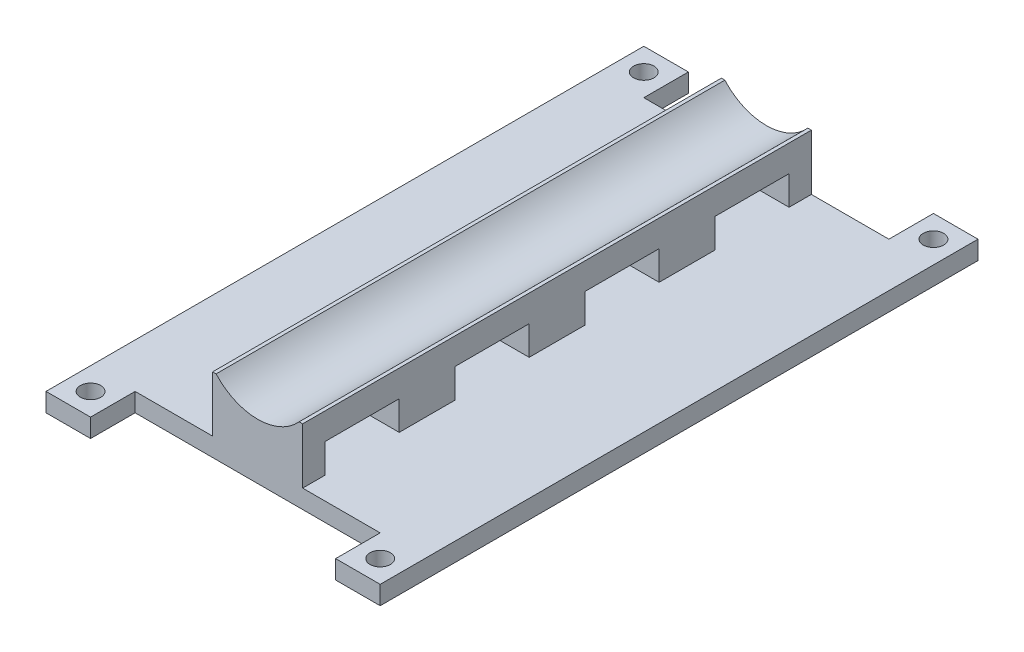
ISO-10303-21;
HEADER;
FILE_DESCRIPTION(('STEP AP214'),'2;1');
FILE_NAME('part.step','',(''),(''),'','','');
FILE_SCHEMA(('AUTOMOTIVE_DESIGN { 1 0 10303 214 1 1 1 1 }'));
ENDSEC;
DATA;
#1=APPLICATION_CONTEXT('core data for automotive mechanical design processes');
#2=APPLICATION_PROTOCOL_DEFINITION('international standard','automotive_design',2000,#1);
#3=PRODUCT_CONTEXT('',#1,'mechanical');
#4=PRODUCT('Part','Part','',(#3));
#5=PRODUCT_RELATED_PRODUCT_CATEGORY('part','',(#4));
#6=PRODUCT_DEFINITION_FORMATION('','',#4);
#7=PRODUCT_DEFINITION_CONTEXT('part definition',#1,'design');
#8=PRODUCT_DEFINITION('design','',#6,#7);
#9=PRODUCT_DEFINITION_SHAPE('','',#8);
#10=(LENGTH_UNIT() NAMED_UNIT(*) SI_UNIT(.MILLI.,.METRE.));
#11=(NAMED_UNIT(*) PLANE_ANGLE_UNIT() SI_UNIT($,.RADIAN.));
#12=(NAMED_UNIT(*) SI_UNIT($,.STERADIAN.) SOLID_ANGLE_UNIT());
#13=UNCERTAINTY_MEASURE_WITH_UNIT(LENGTH_MEASURE(1.E-05),#10,'distance_accuracy_value','');
#14=(GEOMETRIC_REPRESENTATION_CONTEXT(3) GLOBAL_UNCERTAINTY_ASSIGNED_CONTEXT((#13)) GLOBAL_UNIT_ASSIGNED_CONTEXT((#10,
#11,#12)) REPRESENTATION_CONTEXT('',''));
#15=CARTESIAN_POINT('',(0.,0.,0.));
#16=DIRECTION('',(0.,0.,1.));
#17=DIRECTION('',(1.,0.,0.));
#18=AXIS2_PLACEMENT_3D('',#15,#16,#17);
#19=CARTESIAN_POINT('',(0.,5.,0.));
#20=DIRECTION('',(0.,1.,0.));
#21=DIRECTION('',(0.,0.,1.));
#22=AXIS2_PLACEMENT_3D('',#19,#20,#21);
#23=PLANE('',#22);
#24=DIRECTION('',(0.,0.,1.));
#25=VECTOR('',#24,1.);
#26=CARTESIAN_POINT('',(32.8767673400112,5.,-149.));
#27=LINE('',#26,#25);
#28=CARTESIAN_POINT('',(32.8767673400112,4.99999999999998,-53.));
#29=VERTEX_POINT('',#28);
#30=CARTESIAN_POINT('',(32.8767673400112,4.99999999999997,-38.));
#31=VERTEX_POINT('',#30);
#32=EDGE_CURVE('E361',#29,#31,#27,.T.);
#33=ORIENTED_EDGE('',*,*,#32,.F.);
#34=DIRECTION('',(1.,0.,0.));
#35=VECTOR('',#34,1.);
#36=CARTESIAN_POINT('',(0.,4.99999999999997,-53.));
#37=LINE('',#36,#35);
#38=CARTESIAN_POINT('',(57.1232326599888,4.99999999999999,-53.));
#39=VERTEX_POINT('',#38);
#40=EDGE_CURVE('E582',#29,#39,#37,.T.);
#41=ORIENTED_EDGE('',*,*,#40,.T.);
#42=DIRECTION('',(0.,0.,1.));
#43=VECTOR('',#42,1.);
#44=CARTESIAN_POINT('',(57.1232326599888,5.00000000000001,-149.));
#45=LINE('',#44,#43);
#46=CARTESIAN_POINT('',(57.1232326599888,4.99999999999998,-38.));
#47=VERTEX_POINT('',#46);
#48=EDGE_CURVE('E352',#39,#47,#45,.T.);
#49=ORIENTED_EDGE('',*,*,#48,.T.);
#50=DIRECTION('',(1.,0.,0.));
#51=VECTOR('',#50,1.);
#52=CARTESIAN_POINT('',(0.,4.99999999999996,-38.));
#53=LINE('',#52,#51);
#54=EDGE_CURVE('E510',#31,#47,#53,.T.);
#55=ORIENTED_EDGE('',*,*,#54,.F.);
#56=EDGE_LOOP('',(#33,#41,#49,#55));
#57=FACE_BOUND('',#56,.T.);
#58=DIRECTION('',(0.,0.,1.));
#59=VECTOR('',#58,1.);
#60=CARTESIAN_POINT('',(0.,5.,-161.));
#61=LINE('',#60,#59);
#62=CARTESIAN_POINT('',(0.,5.,-161.));
#63=VERTEX_POINT('',#62);
#64=CARTESIAN_POINT('',(0.,5.,0.));
#65=VERTEX_POINT('',#64);
#66=EDGE_CURVE('E119',#63,#65,#61,.T.);
#67=ORIENTED_EDGE('',*,*,#66,.T.);
#68=DIRECTION('',(1.,0.,0.));
#69=VECTOR('',#68,1.);
#70=CARTESIAN_POINT('',(0.,5.,0.));
#71=LINE('',#70,#69);
#72=CARTESIAN_POINT('',(12.,5.,0.));
#73=VERTEX_POINT('',#72);
#74=EDGE_CURVE('E459',#65,#73,#71,.T.);
#75=ORIENTED_EDGE('',*,*,#74,.T.);
#76=DIRECTION('',(0.,0.,-1.));
#77=VECTOR('',#76,1.);
#78=CARTESIAN_POINT('',(12.,5.,0.));
#79=LINE('',#78,#77);
#80=CARTESIAN_POINT('',(12.,5.,-12.));
#81=VERTEX_POINT('',#80);
#82=EDGE_CURVE('E453',#73,#81,#79,.T.);
#83=ORIENTED_EDGE('',*,*,#82,.T.);
#84=DIRECTION('',(1.,0.,0.));
#85=VECTOR('',#84,1.);
#86=CARTESIAN_POINT('',(12.,5.,-12.));
#87=LINE('',#86,#85);
#88=CARTESIAN_POINT('',(32.8767673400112,5.,-12.));
#89=VERTEX_POINT('',#88);
#90=EDGE_CURVE('E452',#81,#89,#87,.T.);
#91=ORIENTED_EDGE('',*,*,#90,.T.);
#92=CARTESIAN_POINT('',(32.8767673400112,4.99999999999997,-18.));
#93=VERTEX_POINT('',#92);
#94=EDGE_CURVE('E362',#93,#89,#27,.T.);
#95=ORIENTED_EDGE('',*,*,#94,.F.);
#96=DIRECTION('',(1.,0.,0.));
#97=VECTOR('',#96,1.);
#98=CARTESIAN_POINT('',(0.,4.99999999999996,-18.));
#99=LINE('',#98,#97);
#100=CARTESIAN_POINT('',(57.1232326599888,4.99999999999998,-18.));
#101=VERTEX_POINT('',#100);
#102=EDGE_CURVE('E511',#93,#101,#99,.T.);
#103=ORIENTED_EDGE('',*,*,#102,.T.);
#104=CARTESIAN_POINT('',(57.1232326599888,5.,-12.));
#105=VERTEX_POINT('',#104);
#106=EDGE_CURVE('E60',#101,#105,#45,.T.);
#107=ORIENTED_EDGE('',*,*,#106,.T.);
#108=CARTESIAN_POINT('',(78.,5.,-12.));
#109=VERTEX_POINT('',#108);
#110=EDGE_CURVE('E449',#105,#109,#87,.T.);
#111=ORIENTED_EDGE('',*,*,#110,.T.);
#112=DIRECTION('',(0.,0.,1.));
#113=VECTOR('',#112,1.);
#114=CARTESIAN_POINT('',(78.,5.,-12.));
#115=LINE('',#114,#113);
#116=CARTESIAN_POINT('',(78.,5.,0.));
#117=VERTEX_POINT('',#116);
#118=EDGE_CURVE('E458',#109,#117,#115,.T.);
#119=ORIENTED_EDGE('',*,*,#118,.T.);
#120=DIRECTION('',(1.,0.,0.));
#121=VECTOR('',#120,1.);
#122=CARTESIAN_POINT('',(78.,5.,0.));
#123=LINE('',#122,#121);
#124=CARTESIAN_POINT('',(90.,5.,0.));
#125=VERTEX_POINT('',#124);
#126=EDGE_CURVE('E465',#117,#125,#123,.T.);
#127=ORIENTED_EDGE('',*,*,#126,.T.);
#128=DIRECTION('',(0.,0.,-1.));
#129=VECTOR('',#128,1.);
#130=CARTESIAN_POINT('',(90.,5.,0.));
#131=LINE('',#130,#129);
#132=CARTESIAN_POINT('',(90.,5.,-161.));
#133=VERTEX_POINT('',#132);
#134=EDGE_CURVE('E468',#125,#133,#131,.T.);
#135=ORIENTED_EDGE('',*,*,#134,.T.);
#136=DIRECTION('',(-1.,0.,0.));
#137=VECTOR('',#136,1.);
#138=CARTESIAN_POINT('',(90.,5.,-161.));
#139=LINE('',#138,#137);
#140=CARTESIAN_POINT('',(78.,5.,-161.));
#141=VERTEX_POINT('',#140);
#142=EDGE_CURVE('E471',#133,#141,#139,.T.);
#143=ORIENTED_EDGE('',*,*,#142,.T.);
#144=DIRECTION('',(0.,0.,1.));
#145=VECTOR('',#144,1.);
#146=CARTESIAN_POINT('',(78.,5.,-161.));
#147=LINE('',#146,#145);
#148=CARTESIAN_POINT('',(78.,5.,-149.));
#149=VERTEX_POINT('',#148);
#150=EDGE_CURVE('E162',#141,#149,#147,.T.);
#151=ORIENTED_EDGE('',*,*,#150,.T.);
#152=DIRECTION('',(-1.,0.,0.));
#153=VECTOR('',#152,1.);
#154=CARTESIAN_POINT('',(78.,5.,-149.));
#155=LINE('',#154,#153);
#156=CARTESIAN_POINT('',(57.1232326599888,5.00000000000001,-149.));
#157=VERTEX_POINT('',#156);
#158=EDGE_CURVE('E161',#149,#157,#155,.T.);
#159=ORIENTED_EDGE('',*,*,#158,.T.);
#160=CARTESIAN_POINT('',(57.1232326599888,5.00000000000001,-143.));
#161=VERTEX_POINT('',#160);
#162=EDGE_CURVE('E345',#157,#161,#45,.T.);
#163=ORIENTED_EDGE('',*,*,#162,.T.);
#164=DIRECTION('',(1.,0.,0.));
#165=VECTOR('',#164,1.);
#166=CARTESIAN_POINT('',(0.,4.99999999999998,-143.));
#167=LINE('',#166,#165);
#168=CARTESIAN_POINT('',(32.8767673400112,5.,-143.));
#169=VERTEX_POINT('',#168);
#170=EDGE_CURVE('E571',#169,#161,#167,.T.);
#171=ORIENTED_EDGE('',*,*,#170,.F.);
#172=CARTESIAN_POINT('',(32.8767673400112,5.,-149.));
#173=VERTEX_POINT('',#172);
#174=EDGE_CURVE('E157',#173,#169,#27,.T.);
#175=ORIENTED_EDGE('',*,*,#174,.F.);
#176=CARTESIAN_POINT('',(12.,5.,-149.));
#177=VERTEX_POINT('',#176);
#178=EDGE_CURVE('E148',#173,#177,#155,.T.);
#179=ORIENTED_EDGE('',*,*,#178,.T.);
#180=DIRECTION('',(0.,0.,-1.));
#181=VECTOR('',#180,1.);
#182=CARTESIAN_POINT('',(12.,5.,-149.));
#183=LINE('',#182,#181);
#184=CARTESIAN_POINT('',(12.,5.,-161.));
#185=VERTEX_POINT('',#184);
#186=EDGE_CURVE('E152',#177,#185,#183,.T.);
#187=ORIENTED_EDGE('',*,*,#186,.T.);
#188=DIRECTION('',(-1.,0.,0.));
#189=VECTOR('',#188,1.);
#190=CARTESIAN_POINT('',(12.,5.,-161.));
#191=LINE('',#190,#189);
#192=EDGE_CURVE('E68',#185,#63,#191,.T.);
#193=ORIENTED_EDGE('',*,*,#192,.T.);
#194=EDGE_LOOP('',(#67,#75,#83,#91,#95,#103,#107,#111,#119,#127,#135,#143,#151,#159,#163,#171,
#175,#179,#187,#193));
#195=FACE_BOUND('',#194,.T.);
#196=DIRECTION('',(1.,0.,0.));
#197=VECTOR('',#196,1.);
#198=CARTESIAN_POINT('',(0.,4.99999999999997,-73.));
#199=LINE('',#198,#197);
#200=CARTESIAN_POINT('',(32.8767673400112,4.99999999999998,-73.));
#201=VERTEX_POINT('',#200);
#202=CARTESIAN_POINT('',(57.1232326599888,4.99999999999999,-73.));
#203=VERTEX_POINT('',#202);
#204=EDGE_CURVE('E567',#201,#203,#199,.T.);
#205=ORIENTED_EDGE('',*,*,#204,.F.);
#206=CARTESIAN_POINT('',(32.8767673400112,4.99999999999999,-88.));
#207=VERTEX_POINT('',#206);
#208=EDGE_CURVE('E369',#207,#201,#27,.T.);
#209=ORIENTED_EDGE('',*,*,#208,.F.);
#210=DIRECTION('',(1.,0.,0.));
#211=VECTOR('',#210,1.);
#212=CARTESIAN_POINT('',(0.,4.99999999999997,-88.));
#213=LINE('',#212,#211);
#214=CARTESIAN_POINT('',(57.1232326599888,5.,-88.));
#215=VERTEX_POINT('',#214);
#216=EDGE_CURVE('E575',#207,#215,#213,.T.);
#217=ORIENTED_EDGE('',*,*,#216,.T.);
#218=EDGE_CURVE('E346',#215,#203,#45,.T.);
#219=ORIENTED_EDGE('',*,*,#218,.T.);
#220=EDGE_LOOP('',(#205,#209,#217,#219));
#221=FACE_BOUND('',#220,.T.);
#222=DIRECTION('',(1.,0.,0.));
#223=VECTOR('',#222,1.);
#224=CARTESIAN_POINT('',(0.,4.99999999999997,-108.));
#225=LINE('',#224,#223);
#226=CARTESIAN_POINT('',(32.8767673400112,4.99999999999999,-108.));
#227=VERTEX_POINT('',#226);
#228=CARTESIAN_POINT('',(57.1232326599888,5.,-108.));
#229=VERTEX_POINT('',#228);
#230=EDGE_CURVE('E579',#227,#229,#225,.T.);
#231=ORIENTED_EDGE('',*,*,#230,.F.);
#232=CARTESIAN_POINT('',(32.8767673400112,5.,-123.));
#233=VERTEX_POINT('',#232);
#234=EDGE_CURVE('E360',#233,#227,#27,.T.);
#235=ORIENTED_EDGE('',*,*,#234,.F.);
#236=DIRECTION('',(1.,0.,0.));
#237=VECTOR('',#236,1.);
#238=CARTESIAN_POINT('',(0.,4.99999999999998,-123.));
#239=LINE('',#238,#237);
#240=CARTESIAN_POINT('',(57.1232326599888,5.00000000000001,-123.));
#241=VERTEX_POINT('',#240);
#242=EDGE_CURVE('E568',#233,#241,#239,.T.);
#243=ORIENTED_EDGE('',*,*,#242,.T.);
#244=EDGE_CURVE('E336',#241,#229,#45,.T.);
#245=ORIENTED_EDGE('',*,*,#244,.T.);
#246=EDGE_LOOP('',(#231,#235,#243,#245));
#247=FACE_BOUND('',#246,.T.);
#248=CARTESIAN_POINT('',(6.,5.,-155.));
#249=DIRECTION('',(0.,1.,0.));
#250=DIRECTION('',(0.,0.,1.));
#251=AXIS2_PLACEMENT_3D('',#248,#249,#250);
#252=CIRCLE('',#251,2.75);
#253=CARTESIAN_POINT('',(6.,5.,-152.25));
#254=VERTEX_POINT('',#253);
#255=EDGE_CURVE('E191',#254,#254,#252,.T.);
#256=ORIENTED_EDGE('',*,*,#255,.F.);
#257=EDGE_LOOP('',(#256));
#258=FACE_BOUND('',#257,.T.);
#259=CARTESIAN_POINT('',(6.00000000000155,5.,-6.00000000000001));
#260=DIRECTION('',(0.,1.,0.));
#261=DIRECTION('',(0.,0.,1.));
#262=AXIS2_PLACEMENT_3D('',#259,#260,#261);
#263=CIRCLE('',#262,2.75);
#264=CARTESIAN_POINT('',(6.00000000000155,5.,-3.25));
#265=VERTEX_POINT('',#264);
#266=EDGE_CURVE('E775',#265,#265,#263,.T.);
#267=ORIENTED_EDGE('',*,*,#266,.F.);
#268=EDGE_LOOP('',(#267));
#269=FACE_BOUND('',#268,.T.);
#270=CARTESIAN_POINT('',(84.0000000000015,5.,-6.00000000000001));
#271=DIRECTION('',(0.,1.,0.));
#272=DIRECTION('',(0.,0.,1.));
#273=AXIS2_PLACEMENT_3D('',#270,#271,#272);
#274=CIRCLE('',#273,2.75000000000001);
#275=CARTESIAN_POINT('',(84.0000000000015,5.,-3.25));
#276=VERTEX_POINT('',#275);
#277=EDGE_CURVE('E767',#276,#276,#274,.T.);
#278=ORIENTED_EDGE('',*,*,#277,.F.);
#279=EDGE_LOOP('',(#278));
#280=FACE_BOUND('',#279,.T.);
#281=CARTESIAN_POINT('',(84.,5.,-155.));
#282=DIRECTION('',(0.,1.,0.));
#283=DIRECTION('',(0.,0.,1.));
#284=AXIS2_PLACEMENT_3D('',#281,#282,#283);
#285=CIRCLE('',#284,2.75000000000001);
#286=CARTESIAN_POINT('',(84.,5.,-152.25));
#287=VERTEX_POINT('',#286);
#288=EDGE_CURVE('E759',#287,#287,#285,.T.);
#289=ORIENTED_EDGE('',*,*,#288,.F.);
#290=EDGE_LOOP('',(#289));
#291=FACE_BOUND('',#290,.T.);
#292=ADVANCED_FACE('F44',(#57,#195,#221,#247,#258,#269,#280,#291),#23,.T.);
#293=CARTESIAN_POINT('',(0.,0.,0.));
#294=DIRECTION('',(0.,1.,0.));
#295=DIRECTION('',(0.,0.,1.));
#296=AXIS2_PLACEMENT_3D('',#293,#294,#295);
#297=PLANE('',#296);
#298=DIRECTION('',(0.,0.,1.));
#299=VECTOR('',#298,1.);
#300=CARTESIAN_POINT('',(0.,0.,-161.));
#301=LINE('',#300,#299);
#302=CARTESIAN_POINT('',(0.,0.,-161.));
#303=VERTEX_POINT('',#302);
#304=CARTESIAN_POINT('',(0.,0.,0.));
#305=VERTEX_POINT('',#304);
#306=EDGE_CURVE('E186',#303,#305,#301,.T.);
#307=ORIENTED_EDGE('',*,*,#306,.F.);
#308=DIRECTION('',(-1.,0.,0.));
#309=VECTOR('',#308,1.);
#310=CARTESIAN_POINT('',(12.,0.,-161.));
#311=LINE('',#310,#309);
#312=CARTESIAN_POINT('',(12.,0.,-161.));
#313=VERTEX_POINT('',#312);
#314=EDGE_CURVE('E113',#313,#303,#311,.T.);
#315=ORIENTED_EDGE('',*,*,#314,.F.);
#316=DIRECTION('',(0.,0.,-1.));
#317=VECTOR('',#316,1.);
#318=CARTESIAN_POINT('',(12.,0.,-149.));
#319=LINE('',#318,#317);
#320=CARTESIAN_POINT('',(12.,0.,-149.));
#321=VERTEX_POINT('',#320);
#322=EDGE_CURVE('E217',#321,#313,#319,.T.);
#323=ORIENTED_EDGE('',*,*,#322,.F.);
#324=DIRECTION('',(-1.,0.,0.));
#325=VECTOR('',#324,1.);
#326=CARTESIAN_POINT('',(78.,0.,-149.));
#327=LINE('',#326,#325);
#328=CARTESIAN_POINT('',(78.,0.,-149.));
#329=VERTEX_POINT('',#328);
#330=EDGE_CURVE('E169',#329,#321,#327,.T.);
#331=ORIENTED_EDGE('',*,*,#330,.F.);
#332=DIRECTION('',(0.,0.,1.));
#333=VECTOR('',#332,1.);
#334=CARTESIAN_POINT('',(78.,0.,-161.));
#335=LINE('',#334,#333);
#336=CARTESIAN_POINT('',(78.,0.,-161.));
#337=VERTEX_POINT('',#336);
#338=EDGE_CURVE('E212',#337,#329,#335,.T.);
#339=ORIENTED_EDGE('',*,*,#338,.F.);
#340=DIRECTION('',(-1.,0.,0.));
#341=VECTOR('',#340,1.);
#342=CARTESIAN_POINT('',(90.,0.,-161.));
#343=LINE('',#342,#341);
#344=CARTESIAN_POINT('',(90.,0.,-161.));
#345=VERTEX_POINT('',#344);
#346=EDGE_CURVE('E209',#345,#337,#343,.T.);
#347=ORIENTED_EDGE('',*,*,#346,.F.);
#348=DIRECTION('',(0.,0.,-1.));
#349=VECTOR('',#348,1.);
#350=CARTESIAN_POINT('',(90.,0.,0.));
#351=LINE('',#350,#349);
#352=CARTESIAN_POINT('',(90.,0.,0.));
#353=VERTEX_POINT('',#352);
#354=EDGE_CURVE('E206',#353,#345,#351,.T.);
#355=ORIENTED_EDGE('',*,*,#354,.F.);
#356=DIRECTION('',(1.,0.,0.));
#357=VECTOR('',#356,1.);
#358=CARTESIAN_POINT('',(78.,0.,0.));
#359=LINE('',#358,#357);
#360=CARTESIAN_POINT('',(78.,0.,0.));
#361=VERTEX_POINT('',#360);
#362=EDGE_CURVE('E203',#361,#353,#359,.T.);
#363=ORIENTED_EDGE('',*,*,#362,.F.);
#364=DIRECTION('',(0.,0.,1.));
#365=VECTOR('',#364,1.);
#366=CARTESIAN_POINT('',(78.,0.,-12.));
#367=LINE('',#366,#365);
#368=CARTESIAN_POINT('',(78.,0.,-12.));
#369=VERTEX_POINT('',#368);
#370=EDGE_CURVE('E200',#369,#361,#367,.T.);
#371=ORIENTED_EDGE('',*,*,#370,.F.);
#372=DIRECTION('',(1.,0.,0.));
#373=VECTOR('',#372,1.);
#374=CARTESIAN_POINT('',(12.,0.,-12.));
#375=LINE('',#374,#373);
#376=CARTESIAN_POINT('',(12.,0.,-12.));
#377=VERTEX_POINT('',#376);
#378=EDGE_CURVE('E197',#377,#369,#375,.T.);
#379=ORIENTED_EDGE('',*,*,#378,.F.);
#380=DIRECTION('',(0.,0.,-1.));
#381=VECTOR('',#380,1.);
#382=CARTESIAN_POINT('',(12.,0.,0.));
#383=LINE('',#382,#381);
#384=CARTESIAN_POINT('',(12.,0.,0.));
#385=VERTEX_POINT('',#384);
#386=EDGE_CURVE('E194',#385,#377,#383,.T.);
#387=ORIENTED_EDGE('',*,*,#386,.F.);
#388=DIRECTION('',(1.,0.,0.));
#389=VECTOR('',#388,1.);
#390=CARTESIAN_POINT('',(0.,0.,0.));
#391=LINE('',#390,#389);
#392=EDGE_CURVE('E190',#305,#385,#391,.T.);
#393=ORIENTED_EDGE('',*,*,#392,.F.);
#394=EDGE_LOOP('',(#307,#315,#323,#331,#339,#347,#355,#363,#371,#379,#387,#393));
#395=FACE_BOUND('',#394,.T.);
#396=CARTESIAN_POINT('',(6.,0.,-155.));
#397=DIRECTION('',(0.,1.,0.));
#398=DIRECTION('',(0.,0.,1.));
#399=AXIS2_PLACEMENT_3D('',#396,#397,#398);
#400=CIRCLE('',#399,2.75);
#401=CARTESIAN_POINT('',(6.,0.,-152.25));
#402=VERTEX_POINT('',#401);
#403=EDGE_CURVE('E755',#402,#402,#400,.T.);
#404=ORIENTED_EDGE('',*,*,#403,.T.);
#405=EDGE_LOOP('',(#404));
#406=FACE_BOUND('',#405,.T.);
#407=CARTESIAN_POINT('',(84.,0.,-155.));
#408=DIRECTION('',(0.,1.,0.));
#409=DIRECTION('',(0.,0.,1.));
#410=AXIS2_PLACEMENT_3D('',#407,#408,#409);
#411=CIRCLE('',#410,2.75000000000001);
#412=CARTESIAN_POINT('',(84.,0.,-152.25));
#413=VERTEX_POINT('',#412);
#414=EDGE_CURVE('E763',#413,#413,#411,.T.);
#415=ORIENTED_EDGE('',*,*,#414,.T.);
#416=EDGE_LOOP('',(#415));
#417=FACE_BOUND('',#416,.T.);
#418=CARTESIAN_POINT('',(84.0000000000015,0.,-6.00000000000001));
#419=DIRECTION('',(0.,1.,0.));
#420=DIRECTION('',(0.,0.,1.));
#421=AXIS2_PLACEMENT_3D('',#418,#419,#420);
#422=CIRCLE('',#421,2.75000000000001);
#423=CARTESIAN_POINT('',(84.0000000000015,0.,-3.25));
#424=VERTEX_POINT('',#423);
#425=EDGE_CURVE('E771',#424,#424,#422,.T.);
#426=ORIENTED_EDGE('',*,*,#425,.T.);
#427=EDGE_LOOP('',(#426));
#428=FACE_BOUND('',#427,.T.);
#429=CARTESIAN_POINT('',(6.00000000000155,0.,-6.00000000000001));
#430=DIRECTION('',(0.,1.,0.));
#431=DIRECTION('',(0.,0.,1.));
#432=AXIS2_PLACEMENT_3D('',#429,#430,#431);
#433=CIRCLE('',#432,2.75);
#434=CARTESIAN_POINT('',(6.00000000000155,0.,-3.25));
#435=VERTEX_POINT('',#434);
#436=EDGE_CURVE('E419',#435,#435,#433,.T.);
#437=ORIENTED_EDGE('',*,*,#436,.T.);
#438=EDGE_LOOP('',(#437));
#439=FACE_BOUND('',#438,.T.);
#440=ADVANCED_FACE('F683',(#395,#406,#417,#428,#439),#297,.F.);
#441=CARTESIAN_POINT('',(0.,5.,-161.));
#442=DIRECTION('',(1.,0.,0.));
#443=DIRECTION('',(0.,0.,-1.));
#444=AXIS2_PLACEMENT_3D('',#441,#442,#443);
#445=PLANE('',#444);
#446=ORIENTED_EDGE('',*,*,#306,.T.);
#447=DIRECTION('',(0.,-1.,0.));
#448=VECTOR('',#447,1.);
#449=CARTESIAN_POINT('',(0.,5.,0.));
#450=LINE('',#449,#448);
#451=EDGE_CURVE('E256',#65,#305,#450,.T.);
#452=ORIENTED_EDGE('',*,*,#451,.F.);
#453=ORIENTED_EDGE('',*,*,#66,.F.);
#454=DIRECTION('',(0.,-1.,0.));
#455=VECTOR('',#454,1.);
#456=CARTESIAN_POINT('',(0.,5.,-161.));
#457=LINE('',#456,#455);
#458=EDGE_CURVE('E181',#63,#303,#457,.T.);
#459=ORIENTED_EDGE('',*,*,#458,.T.);
#460=EDGE_LOOP('',(#446,#452,#453,#459));
#461=FACE_BOUND('',#460,.T.);
#462=ADVANCED_FACE('F46',(#461),#445,.F.);
#463=CARTESIAN_POINT('',(0.,5.,0.));
#464=DIRECTION('',(0.,0.,-1.));
#465=DIRECTION('',(-1.,0.,0.));
#466=AXIS2_PLACEMENT_3D('',#463,#464,#465);
#467=PLANE('',#466);
#468=ORIENTED_EDGE('',*,*,#392,.T.);
#469=DIRECTION('',(0.,-1.,0.));
#470=VECTOR('',#469,1.);
#471=CARTESIAN_POINT('',(12.,5.,0.));
#472=LINE('',#471,#470);
#473=EDGE_CURVE('E252',#73,#385,#472,.T.);
#474=ORIENTED_EDGE('',*,*,#473,.F.);
#475=ORIENTED_EDGE('',*,*,#74,.F.);
#476=ORIENTED_EDGE('',*,*,#451,.T.);
#477=EDGE_LOOP('',(#468,#474,#475,#476));
#478=FACE_BOUND('',#477,.T.);
#479=ADVANCED_FACE('F727',(#478),#467,.F.);
#480=CARTESIAN_POINT('',(12.,5.,0.));
#481=DIRECTION('',(-1.,0.,0.));
#482=DIRECTION('',(0.,0.,1.));
#483=AXIS2_PLACEMENT_3D('',#480,#481,#482);
#484=PLANE('',#483);
#485=ORIENTED_EDGE('',*,*,#386,.T.);
#486=DIRECTION('',(0.,-1.,0.));
#487=VECTOR('',#486,1.);
#488=CARTESIAN_POINT('',(12.,5.,-12.));
#489=LINE('',#488,#487);
#490=EDGE_CURVE('E248',#81,#377,#489,.T.);
#491=ORIENTED_EDGE('',*,*,#490,.F.);
#492=ORIENTED_EDGE('',*,*,#82,.F.);
#493=ORIENTED_EDGE('',*,*,#473,.T.);
#494=EDGE_LOOP('',(#485,#491,#492,#493));
#495=FACE_BOUND('',#494,.T.);
#496=ADVANCED_FACE('F725',(#495),#484,.F.);
#497=CARTESIAN_POINT('',(12.,5.,-12.));
#498=DIRECTION('',(0.,0.,-1.));
#499=DIRECTION('',(-1.,0.,0.));
#500=AXIS2_PLACEMENT_3D('',#497,#498,#499);
#501=PLANE('',#500);
#502=ORIENTED_EDGE('',*,*,#378,.T.);
#503=DIRECTION('',(0.,-1.,0.));
#504=VECTOR('',#503,1.);
#505=CARTESIAN_POINT('',(78.,5.,-12.));
#506=LINE('',#505,#504);
#507=EDGE_CURVE('E244',#109,#369,#506,.T.);
#508=ORIENTED_EDGE('',*,*,#507,.F.);
#509=ORIENTED_EDGE('',*,*,#110,.F.);
#510=DIRECTION('',(0.,1.,0.));
#511=VECTOR('',#510,1.);
#512=CARTESIAN_POINT('',(57.1232326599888,5.00000000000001,-12.));
#513=LINE('',#512,#511);
#514=CARTESIAN_POINT('',(57.1232326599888,20.,-12.));
#515=VERTEX_POINT('',#514);
#516=EDGE_CURVE('E398',#105,#515,#513,.T.);
#517=ORIENTED_EDGE('',*,*,#516,.T.);
#518=DIRECTION('',(-1.,0.,0.));
#519=VECTOR('',#518,1.);
#520=CARTESIAN_POINT('',(56.1803398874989,20.,-12.));
#521=LINE('',#520,#519);
#522=CARTESIAN_POINT('',(56.1803398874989,20.,-12.));
#523=VERTEX_POINT('',#522);
#524=EDGE_CURVE('E403',#515,#523,#521,.T.);
#525=ORIENTED_EDGE('',*,*,#524,.T.);
#526=CARTESIAN_POINT('',(45.,30.,-12.));
#527=DIRECTION('',(0.,0.,-1.));
#528=DIRECTION('',(1.,0.,0.));
#529=AXIS2_PLACEMENT_3D('',#526,#527,#528);
#530=CIRCLE('',#529,15.);
#531=CARTESIAN_POINT('',(33.819660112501,20.,-12.));
#532=VERTEX_POINT('',#531);
#533=EDGE_CURVE('E407',#523,#532,#530,.T.);
#534=ORIENTED_EDGE('',*,*,#533,.T.);
#535=DIRECTION('',(-1.,0.,0.));
#536=VECTOR('',#535,1.);
#537=CARTESIAN_POINT('',(32.8767673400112,20.,-12.));
#538=LINE('',#537,#536);
#539=CARTESIAN_POINT('',(32.8767673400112,20.,-12.));
#540=VERTEX_POINT('',#539);
#541=EDGE_CURVE('E411',#532,#540,#538,.T.);
#542=ORIENTED_EDGE('',*,*,#541,.T.);
#543=DIRECTION('',(0.,-1.,0.));
#544=VECTOR('',#543,1.);
#545=CARTESIAN_POINT('',(32.8767673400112,5.,-12.));
#546=LINE('',#545,#544);
#547=EDGE_CURVE('E395',#540,#89,#546,.T.);
#548=ORIENTED_EDGE('',*,*,#547,.T.);
#549=ORIENTED_EDGE('',*,*,#90,.F.);
#550=ORIENTED_EDGE('',*,*,#490,.T.);
#551=EDGE_LOOP('',(#502,#508,#509,#517,#525,#534,#542,#548,#549,#550));
#552=FACE_BOUND('',#551,.T.);
#553=ADVANCED_FACE('F447',(#552),#501,.F.);
#554=CARTESIAN_POINT('',(78.,5.,-12.));
#555=DIRECTION('',(1.,0.,0.));
#556=DIRECTION('',(0.,0.,-1.));
#557=AXIS2_PLACEMENT_3D('',#554,#555,#556);
#558=PLANE('',#557);
#559=ORIENTED_EDGE('',*,*,#370,.T.);
#560=DIRECTION('',(0.,-1.,0.));
#561=VECTOR('',#560,1.);
#562=CARTESIAN_POINT('',(78.,5.,0.));
#563=LINE('',#562,#561);
#564=EDGE_CURVE('E240',#117,#361,#563,.T.);
#565=ORIENTED_EDGE('',*,*,#564,.F.);
#566=ORIENTED_EDGE('',*,*,#118,.F.);
#567=ORIENTED_EDGE('',*,*,#507,.T.);
#568=EDGE_LOOP('',(#559,#565,#566,#567));
#569=FACE_BOUND('',#568,.T.);
#570=ADVANCED_FACE('F718',(#569),#558,.F.);
#571=CARTESIAN_POINT('',(78.,5.,0.));
#572=DIRECTION('',(0.,0.,-1.));
#573=DIRECTION('',(-1.,0.,0.));
#574=AXIS2_PLACEMENT_3D('',#571,#572,#573);
#575=PLANE('',#574);
#576=ORIENTED_EDGE('',*,*,#362,.T.);
#577=DIRECTION('',(0.,-1.,0.));
#578=VECTOR('',#577,1.);
#579=CARTESIAN_POINT('',(90.,5.,0.));
#580=LINE('',#579,#578);
#581=EDGE_CURVE('E236',#125,#353,#580,.T.);
#582=ORIENTED_EDGE('',*,*,#581,.F.);
#583=ORIENTED_EDGE('',*,*,#126,.F.);
#584=ORIENTED_EDGE('',*,*,#564,.T.);
#585=EDGE_LOOP('',(#576,#582,#583,#584));
#586=FACE_BOUND('',#585,.T.);
#587=ADVANCED_FACE('F714',(#586),#575,.F.);
#588=CARTESIAN_POINT('',(90.,5.,0.));
#589=DIRECTION('',(-1.,0.,0.));
#590=DIRECTION('',(0.,0.,1.));
#591=AXIS2_PLACEMENT_3D('',#588,#589,#590);
#592=PLANE('',#591);
#593=ORIENTED_EDGE('',*,*,#354,.T.);
#594=DIRECTION('',(0.,-1.,0.));
#595=VECTOR('',#594,1.);
#596=CARTESIAN_POINT('',(90.,5.,-161.));
#597=LINE('',#596,#595);
#598=EDGE_CURVE('E232',#133,#345,#597,.T.);
#599=ORIENTED_EDGE('',*,*,#598,.F.);
#600=ORIENTED_EDGE('',*,*,#134,.F.);
#601=ORIENTED_EDGE('',*,*,#581,.T.);
#602=EDGE_LOOP('',(#593,#599,#600,#601));
#603=FACE_BOUND('',#602,.T.);
#604=ADVANCED_FACE('F710',(#603),#592,.F.);
#605=CARTESIAN_POINT('',(90.,5.,-161.));
#606=DIRECTION('',(0.,0.,1.));
#607=DIRECTION('',(1.,0.,0.));
#608=AXIS2_PLACEMENT_3D('',#605,#606,#607);
#609=PLANE('',#608);
#610=ORIENTED_EDGE('',*,*,#346,.T.);
#611=DIRECTION('',(0.,-1.,0.));
#612=VECTOR('',#611,1.);
#613=CARTESIAN_POINT('',(78.,5.,-161.));
#614=LINE('',#613,#612);
#615=EDGE_CURVE('E228',#141,#337,#614,.T.);
#616=ORIENTED_EDGE('',*,*,#615,.F.);
#617=ORIENTED_EDGE('',*,*,#142,.F.);
#618=ORIENTED_EDGE('',*,*,#598,.T.);
#619=EDGE_LOOP('',(#610,#616,#617,#618));
#620=FACE_BOUND('',#619,.T.);
#621=ADVANCED_FACE('F707',(#620),#609,.F.);
#622=CARTESIAN_POINT('',(78.,5.,-161.));
#623=DIRECTION('',(1.,0.,0.));
#624=DIRECTION('',(0.,0.,-1.));
#625=AXIS2_PLACEMENT_3D('',#622,#623,#624);
#626=PLANE('',#625);
#627=ORIENTED_EDGE('',*,*,#338,.T.);
#628=DIRECTION('',(0.,-1.,0.));
#629=VECTOR('',#628,1.);
#630=CARTESIAN_POINT('',(78.,5.,-149.));
#631=LINE('',#630,#629);
#632=EDGE_CURVE('E173',#149,#329,#631,.T.);
#633=ORIENTED_EDGE('',*,*,#632,.F.);
#634=ORIENTED_EDGE('',*,*,#150,.F.);
#635=ORIENTED_EDGE('',*,*,#615,.T.);
#636=EDGE_LOOP('',(#627,#633,#634,#635));
#637=FACE_BOUND('',#636,.T.);
#638=ADVANCED_FACE('F481',(#637),#626,.F.);
#639=CARTESIAN_POINT('',(78.,5.,-149.));
#640=DIRECTION('',(0.,0.,1.));
#641=DIRECTION('',(1.,0.,0.));
#642=AXIS2_PLACEMENT_3D('',#639,#640,#641);
#643=PLANE('',#642);
#644=ORIENTED_EDGE('',*,*,#330,.T.);
#645=DIRECTION('',(0.,-1.,0.));
#646=VECTOR('',#645,1.);
#647=CARTESIAN_POINT('',(12.,5.,-149.));
#648=LINE('',#647,#646);
#649=EDGE_CURVE('E165',#177,#321,#648,.T.);
#650=ORIENTED_EDGE('',*,*,#649,.F.);
#651=ORIENTED_EDGE('',*,*,#178,.F.);
#652=DIRECTION('',(0.,-1.,0.));
#653=VECTOR('',#652,1.);
#654=CARTESIAN_POINT('',(32.8767673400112,5.,-149.));
#655=LINE('',#654,#653);
#656=CARTESIAN_POINT('',(32.8767673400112,20.,-149.));
#657=VERTEX_POINT('',#656);
#658=EDGE_CURVE('E415',#657,#173,#655,.T.);
#659=ORIENTED_EDGE('',*,*,#658,.F.);
#660=DIRECTION('',(-1.,0.,0.));
#661=VECTOR('',#660,1.);
#662=CARTESIAN_POINT('',(32.8767673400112,20.,-149.));
#663=LINE('',#662,#661);
#664=CARTESIAN_POINT('',(33.819660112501,20.,-149.));
#665=VERTEX_POINT('',#664);
#666=EDGE_CURVE('E375',#665,#657,#663,.T.);
#667=ORIENTED_EDGE('',*,*,#666,.F.);
#668=CARTESIAN_POINT('',(45.,30.,-149.));
#669=DIRECTION('',(0.,0.,-1.));
#670=DIRECTION('',(1.,0.,0.));
#671=AXIS2_PLACEMENT_3D('',#668,#669,#670);
#672=CIRCLE('',#671,15.);
#673=CARTESIAN_POINT('',(56.1803398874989,20.,-149.));
#674=VERTEX_POINT('',#673);
#675=EDGE_CURVE('E383',#674,#665,#672,.T.);
#676=ORIENTED_EDGE('',*,*,#675,.F.);
#677=DIRECTION('',(-1.,0.,0.));
#678=VECTOR('',#677,1.);
#679=CARTESIAN_POINT('',(56.1803398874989,20.,-149.));
#680=LINE('',#679,#678);
#681=CARTESIAN_POINT('',(57.1232326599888,20.,-149.));
#682=VERTEX_POINT('',#681);
#683=EDGE_CURVE('E391',#682,#674,#680,.T.);
#684=ORIENTED_EDGE('',*,*,#683,.F.);
#685=DIRECTION('',(0.,1.,0.));
#686=VECTOR('',#685,1.);
#687=CARTESIAN_POINT('',(57.1232326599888,5.00000000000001,-149.));
#688=LINE('',#687,#686);
#689=EDGE_CURVE('E437',#157,#682,#688,.T.);
#690=ORIENTED_EDGE('',*,*,#689,.F.);
#691=ORIENTED_EDGE('',*,*,#158,.F.);
#692=ORIENTED_EDGE('',*,*,#632,.T.);
#693=EDGE_LOOP('',(#644,#650,#651,#659,#667,#676,#684,#690,#691,#692));
#694=FACE_BOUND('',#693,.T.);
#695=ADVANCED_FACE('F166',(#694),#643,.F.);
#696=CARTESIAN_POINT('',(12.,5.,-149.));
#697=DIRECTION('',(-1.,0.,0.));
#698=DIRECTION('',(0.,0.,1.));
#699=AXIS2_PLACEMENT_3D('',#696,#697,#698);
#700=PLANE('',#699);
#701=ORIENTED_EDGE('',*,*,#322,.T.);
#702=DIRECTION('',(0.,-1.,0.));
#703=VECTOR('',#702,1.);
#704=CARTESIAN_POINT('',(12.,5.,-161.));
#705=LINE('',#704,#703);
#706=EDGE_CURVE('E174',#185,#313,#705,.T.);
#707=ORIENTED_EDGE('',*,*,#706,.F.);
#708=ORIENTED_EDGE('',*,*,#186,.F.);
#709=ORIENTED_EDGE('',*,*,#649,.T.);
#710=EDGE_LOOP('',(#701,#707,#708,#709));
#711=FACE_BOUND('',#710,.T.);
#712=ADVANCED_FACE('F176',(#711),#700,.F.);
#713=CARTESIAN_POINT('',(12.,5.,-161.));
#714=DIRECTION('',(0.,0.,1.));
#715=DIRECTION('',(1.,0.,0.));
#716=AXIS2_PLACEMENT_3D('',#713,#714,#715);
#717=PLANE('',#716);
#718=ORIENTED_EDGE('',*,*,#314,.T.);
#719=ORIENTED_EDGE('',*,*,#458,.F.);
#720=ORIENTED_EDGE('',*,*,#192,.F.);
#721=ORIENTED_EDGE('',*,*,#706,.T.);
#722=EDGE_LOOP('',(#718,#719,#720,#721));
#723=FACE_BOUND('',#722,.T.);
#724=ADVANCED_FACE('F698',(#723),#717,.F.);
#725=CARTESIAN_POINT('',(6.,5.,-155.));
#726=DIRECTION('',(0.,-1.,0.));
#727=DIRECTION('',(0.,0.,-1.));
#728=AXIS2_PLACEMENT_3D('',#725,#726,#727);
#729=CYLINDRICAL_SURFACE('',#728,2.75);
#730=ORIENTED_EDGE('',*,*,#255,.T.);
#731=EDGE_LOOP('',(#730));
#732=FACE_BOUND('',#731,.T.);
#733=ORIENTED_EDGE('',*,*,#403,.F.);
#734=EDGE_LOOP('',(#733));
#735=FACE_BOUND('',#734,.T.);
#736=ADVANCED_FACE('F695',(#732,#735),#729,.F.);
#737=CARTESIAN_POINT('',(84.,5.,-155.));
#738=DIRECTION('',(0.,-1.,0.));
#739=DIRECTION('',(0.,0.,-1.));
#740=AXIS2_PLACEMENT_3D('',#737,#738,#739);
#741=CYLINDRICAL_SURFACE('',#740,2.75000000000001);
#742=ORIENTED_EDGE('',*,*,#288,.T.);
#743=EDGE_LOOP('',(#742));
#744=FACE_BOUND('',#743,.T.);
#745=ORIENTED_EDGE('',*,*,#414,.F.);
#746=EDGE_LOOP('',(#745));
#747=FACE_BOUND('',#746,.T.);
#748=ADVANCED_FACE('F793',(#744,#747),#741,.F.);
#749=CARTESIAN_POINT('',(84.0000000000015,5.,-6.00000000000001));
#750=DIRECTION('',(0.,-1.,0.));
#751=DIRECTION('',(0.,0.,-1.));
#752=AXIS2_PLACEMENT_3D('',#749,#750,#751);
#753=CYLINDRICAL_SURFACE('',#752,2.75000000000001);
#754=ORIENTED_EDGE('',*,*,#277,.T.);
#755=EDGE_LOOP('',(#754));
#756=FACE_BOUND('',#755,.T.);
#757=ORIENTED_EDGE('',*,*,#425,.F.);
#758=EDGE_LOOP('',(#757));
#759=FACE_BOUND('',#758,.T.);
#760=ADVANCED_FACE('F796',(#756,#759),#753,.F.);
#761=CARTESIAN_POINT('',(6.00000000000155,5.,-6.00000000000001));
#762=DIRECTION('',(0.,-1.,0.));
#763=DIRECTION('',(0.,0.,-1.));
#764=AXIS2_PLACEMENT_3D('',#761,#762,#763);
#765=CYLINDRICAL_SURFACE('',#764,2.75);
#766=ORIENTED_EDGE('',*,*,#266,.T.);
#767=EDGE_LOOP('',(#766));
#768=FACE_BOUND('',#767,.T.);
#769=ORIENTED_EDGE('',*,*,#436,.F.);
#770=EDGE_LOOP('',(#769));
#771=FACE_BOUND('',#770,.T.);
#772=ADVANCED_FACE('F785',(#768,#771),#765,.F.);
#773=CARTESIAN_POINT('',(32.8767673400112,5.,-149.));
#774=DIRECTION('',(-1.,0.,0.));
#775=DIRECTION('',(0.,0.,1.));
#776=AXIS2_PLACEMENT_3D('',#773,#774,#775);
#777=PLANE('',#776);
#778=DIRECTION('',(0.,1.,0.));
#779=VECTOR('',#778,1.);
#780=CARTESIAN_POINT('',(32.8767673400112,5.,-53.));
#781=LINE('',#780,#779);
#782=CARTESIAN_POINT('',(32.8767673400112,12.8527777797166,-53.));
#783=VERTEX_POINT('',#782);
#784=EDGE_CURVE('E514',#29,#783,#781,.T.);
#785=ORIENTED_EDGE('',*,*,#784,.F.);
#786=ORIENTED_EDGE('',*,*,#32,.T.);
#787=DIRECTION('',(0.,-1.,0.));
#788=VECTOR('',#787,1.);
#789=CARTESIAN_POINT('',(32.8767673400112,5.,-38.));
#790=LINE('',#789,#788);
#791=CARTESIAN_POINT('',(32.8767673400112,12.8527777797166,-38.));
#792=VERTEX_POINT('',#791);
#793=EDGE_CURVE('E498',#792,#31,#790,.T.);
#794=ORIENTED_EDGE('',*,*,#793,.F.);
#795=DIRECTION('',(0.,0.,1.));
#796=VECTOR('',#795,1.);
#797=CARTESIAN_POINT('',(32.8767673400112,12.8527777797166,-12.));
#798=LINE('',#797,#796);
#799=CARTESIAN_POINT('',(32.8767673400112,12.8527777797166,-18.));
#800=VERTEX_POINT('',#799);
#801=EDGE_CURVE('E494',#800,#792,#798,.F.);
#802=ORIENTED_EDGE('',*,*,#801,.F.);
#803=DIRECTION('',(0.,1.,0.));
#804=VECTOR('',#803,1.);
#805=CARTESIAN_POINT('',(32.8767673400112,5.,-18.));
#806=LINE('',#805,#804);
#807=EDGE_CURVE('E399',#93,#800,#806,.T.);
#808=ORIENTED_EDGE('',*,*,#807,.F.);
#809=ORIENTED_EDGE('',*,*,#94,.T.);
#810=ORIENTED_EDGE('',*,*,#547,.F.);
#811=DIRECTION('',(0.,0.,1.));
#812=VECTOR('',#811,1.);
#813=CARTESIAN_POINT('',(32.8767673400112,20.,-149.));
#814=LINE('',#813,#812);
#815=EDGE_CURVE('E416',#657,#540,#814,.T.);
#816=ORIENTED_EDGE('',*,*,#815,.F.);
#817=ORIENTED_EDGE('',*,*,#658,.T.);
#818=ORIENTED_EDGE('',*,*,#174,.T.);
#819=DIRECTION('',(0.,-1.,0.));
#820=VECTOR('',#819,1.);
#821=CARTESIAN_POINT('',(32.8767673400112,5.,-143.));
#822=LINE('',#821,#820);
#823=CARTESIAN_POINT('',(32.8767673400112,12.8527777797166,-143.));
#824=VERTEX_POINT('',#823);
#825=EDGE_CURVE('E329',#824,#169,#822,.T.);
#826=ORIENTED_EDGE('',*,*,#825,.F.);
#827=DIRECTION('',(0.,0.,1.));
#828=VECTOR('',#827,1.);
#829=CARTESIAN_POINT('',(32.8767673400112,12.8527777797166,-117.));
#830=LINE('',#829,#828);
#831=CARTESIAN_POINT('',(32.8767673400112,12.8527777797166,-123.));
#832=VERTEX_POINT('',#831);
#833=EDGE_CURVE('E559',#832,#824,#830,.F.);
#834=ORIENTED_EDGE('',*,*,#833,.F.);
#835=DIRECTION('',(0.,1.,0.));
#836=VECTOR('',#835,1.);
#837=CARTESIAN_POINT('',(32.8767673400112,5.,-123.));
#838=LINE('',#837,#836);
#839=EDGE_CURVE('E327',#233,#832,#838,.T.);
#840=ORIENTED_EDGE('',*,*,#839,.F.);
#841=ORIENTED_EDGE('',*,*,#234,.T.);
#842=DIRECTION('',(0.,-1.,0.));
#843=VECTOR('',#842,1.);
#844=CARTESIAN_POINT('',(32.8767673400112,5.,-108.));
#845=LINE('',#844,#843);
#846=CARTESIAN_POINT('',(32.8767673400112,12.8527777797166,-108.));
#847=VERTEX_POINT('',#846);
#848=EDGE_CURVE('E545',#847,#227,#845,.T.);
#849=ORIENTED_EDGE('',*,*,#848,.F.);
#850=DIRECTION('',(0.,0.,1.));
#851=VECTOR('',#850,1.);
#852=CARTESIAN_POINT('',(32.8767673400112,12.8527777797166,-82.));
#853=LINE('',#852,#851);
#854=CARTESIAN_POINT('',(32.8767673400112,12.8527777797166,-88.));
#855=VERTEX_POINT('',#854);
#856=EDGE_CURVE('E541',#855,#847,#853,.F.);
#857=ORIENTED_EDGE('',*,*,#856,.F.);
#858=DIRECTION('',(0.,1.,0.));
#859=VECTOR('',#858,1.);
#860=CARTESIAN_POINT('',(32.8767673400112,5.,-88.));
#861=LINE('',#860,#859);
#862=EDGE_CURVE('E537',#207,#855,#861,.T.);
#863=ORIENTED_EDGE('',*,*,#862,.F.);
#864=ORIENTED_EDGE('',*,*,#208,.T.);
#865=DIRECTION('',(0.,-1.,0.));
#866=VECTOR('',#865,1.);
#867=CARTESIAN_POINT('',(32.8767673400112,5.,-73.));
#868=LINE('',#867,#866);
#869=CARTESIAN_POINT('',(32.8767673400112,12.8527777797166,-73.));
#870=VERTEX_POINT('',#869);
#871=EDGE_CURVE('E525',#870,#201,#868,.T.);
#872=ORIENTED_EDGE('',*,*,#871,.F.);
#873=DIRECTION('',(0.,0.,1.));
#874=VECTOR('',#873,1.);
#875=CARTESIAN_POINT('',(32.8767673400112,12.8527777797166,-47.));
#876=LINE('',#875,#874);
#877=EDGE_CURVE('E521',#783,#870,#876,.F.);
#878=ORIENTED_EDGE('',*,*,#877,.F.);
#879=EDGE_LOOP('',(#785,#786,#794,#802,#808,#809,#810,#816,#817,#818,#826,#834,#840,#841,#849,
#857,#863,#864,#872,#878));
#880=FACE_BOUND('',#879,.T.);
#881=ADVANCED_FACE('F671',(#880),#777,.T.);
#882=CARTESIAN_POINT('',(32.8767673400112,20.,-149.));
#883=DIRECTION('',(0.,1.,0.));
#884=DIRECTION('',(0.,0.,1.));
#885=AXIS2_PLACEMENT_3D('',#882,#883,#884);
#886=PLANE('',#885);
#887=ORIENTED_EDGE('',*,*,#541,.F.);
#888=DIRECTION('',(0.,0.,1.));
#889=VECTOR('',#888,1.);
#890=CARTESIAN_POINT('',(33.819660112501,20.,-149.));
#891=LINE('',#890,#889);
#892=EDGE_CURVE('E420',#665,#532,#891,.T.);
#893=ORIENTED_EDGE('',*,*,#892,.F.);
#894=ORIENTED_EDGE('',*,*,#666,.T.);
#895=ORIENTED_EDGE('',*,*,#815,.T.);
#896=EDGE_LOOP('',(#887,#893,#894,#895));
#897=FACE_BOUND('',#896,.T.);
#898=ADVANCED_FACE('F670',(#897),#886,.T.);
#899=CARTESIAN_POINT('',(45.,30.,-149.));
#900=DIRECTION('',(0.,0.,1.));
#901=DIRECTION('',(1.,0.,0.));
#902=AXIS2_PLACEMENT_3D('',#899,#900,#901);
#903=CYLINDRICAL_SURFACE('',#902,15.);
#904=ORIENTED_EDGE('',*,*,#533,.F.);
#905=DIRECTION('',(0.,0.,1.));
#906=VECTOR('',#905,1.);
#907=CARTESIAN_POINT('',(56.1803398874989,20.,-149.));
#908=LINE('',#907,#906);
#909=EDGE_CURVE('E424',#674,#523,#908,.T.);
#910=ORIENTED_EDGE('',*,*,#909,.F.);
#911=ORIENTED_EDGE('',*,*,#675,.T.);
#912=ORIENTED_EDGE('',*,*,#892,.T.);
#913=EDGE_LOOP('',(#904,#910,#911,#912));
#914=FACE_BOUND('',#913,.T.);
#915=ADVANCED_FACE('F673',(#914),#903,.F.);
#916=CARTESIAN_POINT('',(56.1803398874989,20.,-149.));
#917=DIRECTION('',(0.,1.,0.));
#918=DIRECTION('',(0.,0.,1.));
#919=AXIS2_PLACEMENT_3D('',#916,#917,#918);
#920=PLANE('',#919);
#921=ORIENTED_EDGE('',*,*,#524,.F.);
#922=DIRECTION('',(0.,0.,1.));
#923=VECTOR('',#922,1.);
#924=CARTESIAN_POINT('',(57.1232326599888,20.,-149.));
#925=LINE('',#924,#923);
#926=EDGE_CURVE('E351',#682,#515,#925,.T.);
#927=ORIENTED_EDGE('',*,*,#926,.F.);
#928=ORIENTED_EDGE('',*,*,#683,.T.);
#929=ORIENTED_EDGE('',*,*,#909,.T.);
#930=EDGE_LOOP('',(#921,#927,#928,#929));
#931=FACE_BOUND('',#930,.T.);
#932=ADVANCED_FACE('F443',(#931),#920,.T.);
#933=CARTESIAN_POINT('',(57.1232326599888,5.00000000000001,-149.));
#934=DIRECTION('',(1.,0.,0.));
#935=DIRECTION('',(0.,1.,0.));
#936=AXIS2_PLACEMENT_3D('',#933,#934,#935);
#937=PLANE('',#936);
#938=ORIENTED_EDGE('',*,*,#48,.F.);
#939=DIRECTION('',(0.,-1.,0.));
#940=VECTOR('',#939,1.);
#941=CARTESIAN_POINT('',(57.1232326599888,5.00000000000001,-53.));
#942=LINE('',#941,#940);
#943=CARTESIAN_POINT('',(57.1232326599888,12.8527777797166,-53.));
#944=VERTEX_POINT('',#943);
#945=EDGE_CURVE('E280',#944,#39,#942,.T.);
#946=ORIENTED_EDGE('',*,*,#945,.F.);
#947=DIRECTION('',(0.,0.,1.));
#948=VECTOR('',#947,1.);
#949=CARTESIAN_POINT('',(57.1232326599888,12.8527777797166,-47.));
#950=LINE('',#949,#948);
#951=CARTESIAN_POINT('',(57.1232326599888,12.8527777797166,-73.));
#952=VERTEX_POINT('',#951);
#953=EDGE_CURVE('E276',#952,#944,#950,.T.);
#954=ORIENTED_EDGE('',*,*,#953,.F.);
#955=DIRECTION('',(0.,1.,0.));
#956=VECTOR('',#955,1.);
#957=CARTESIAN_POINT('',(57.1232326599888,5.00000000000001,-73.));
#958=LINE('',#957,#956);
#959=EDGE_CURVE('E272',#203,#952,#958,.T.);
#960=ORIENTED_EDGE('',*,*,#959,.F.);
#961=ORIENTED_EDGE('',*,*,#218,.F.);
#962=DIRECTION('',(0.,-1.,0.));
#963=VECTOR('',#962,1.);
#964=CARTESIAN_POINT('',(57.1232326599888,5.00000000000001,-88.));
#965=LINE('',#964,#963);
#966=CARTESIAN_POINT('',(57.1232326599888,12.8527777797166,-88.));
#967=VERTEX_POINT('',#966);
#968=EDGE_CURVE('E292',#967,#215,#965,.T.);
#969=ORIENTED_EDGE('',*,*,#968,.F.);
#970=DIRECTION('',(0.,0.,1.));
#971=VECTOR('',#970,1.);
#972=CARTESIAN_POINT('',(57.1232326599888,12.8527777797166,-82.));
#973=LINE('',#972,#971);
#974=CARTESIAN_POINT('',(57.1232326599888,12.8527777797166,-108.));
#975=VERTEX_POINT('',#974);
#976=EDGE_CURVE('E288',#975,#967,#973,.T.);
#977=ORIENTED_EDGE('',*,*,#976,.F.);
#978=DIRECTION('',(0.,1.,0.));
#979=VECTOR('',#978,1.);
#980=CARTESIAN_POINT('',(57.1232326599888,5.00000000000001,-108.));
#981=LINE('',#980,#979);
#982=EDGE_CURVE('E284',#229,#975,#981,.T.);
#983=ORIENTED_EDGE('',*,*,#982,.F.);
#984=ORIENTED_EDGE('',*,*,#244,.F.);
#985=DIRECTION('',(0.,-1.,0.));
#986=VECTOR('',#985,1.);
#987=CARTESIAN_POINT('',(57.1232326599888,5.00000000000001,-123.));
#988=LINE('',#987,#986);
#989=CARTESIAN_POINT('',(57.1232326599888,12.8527777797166,-123.));
#990=VERTEX_POINT('',#989);
#991=EDGE_CURVE('E11',#990,#241,#988,.T.);
#992=ORIENTED_EDGE('',*,*,#991,.F.);
#993=DIRECTION('',(0.,0.,1.));
#994=VECTOR('',#993,1.);
#995=CARTESIAN_POINT('',(57.1232326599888,12.8527777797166,-117.));
#996=LINE('',#995,#994);
#997=CARTESIAN_POINT('',(57.1232326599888,12.8527777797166,-143.));
#998=VERTEX_POINT('',#997);
#999=EDGE_CURVE('E53',#998,#990,#996,.T.);
#1000=ORIENTED_EDGE('',*,*,#999,.F.);
#1001=DIRECTION('',(0.,1.,0.));
#1002=VECTOR('',#1001,1.);
#1003=CARTESIAN_POINT('',(57.1232326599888,5.00000000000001,-143.));
#1004=LINE('',#1003,#1002);
#1005=EDGE_CURVE('E296',#161,#998,#1004,.T.);
#1006=ORIENTED_EDGE('',*,*,#1005,.F.);
#1007=ORIENTED_EDGE('',*,*,#162,.F.);
#1008=ORIENTED_EDGE('',*,*,#689,.T.);
#1009=ORIENTED_EDGE('',*,*,#926,.T.);
#1010=ORIENTED_EDGE('',*,*,#516,.F.);
#1011=ORIENTED_EDGE('',*,*,#106,.F.);
#1012=DIRECTION('',(0.,-1.,0.));
#1013=VECTOR('',#1012,1.);
#1014=CARTESIAN_POINT('',(57.1232326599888,5.00000000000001,-18.));
#1015=LINE('',#1014,#1013);
#1016=CARTESIAN_POINT('',(57.1232326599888,12.8527777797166,-18.));
#1017=VERTEX_POINT('',#1016);
#1018=EDGE_CURVE('E268',#1017,#101,#1015,.T.);
#1019=ORIENTED_EDGE('',*,*,#1018,.F.);
#1020=DIRECTION('',(0.,0.,1.));
#1021=VECTOR('',#1020,1.);
#1022=CARTESIAN_POINT('',(57.1232326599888,12.8527777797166,-12.));
#1023=LINE('',#1022,#1021);
#1024=CARTESIAN_POINT('',(57.1232326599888,12.8527777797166,-38.));
#1025=VERTEX_POINT('',#1024);
#1026=EDGE_CURVE('E264',#1025,#1017,#1023,.T.);
#1027=ORIENTED_EDGE('',*,*,#1026,.F.);
#1028=DIRECTION('',(0.,1.,0.));
#1029=VECTOR('',#1028,1.);
#1030=CARTESIAN_POINT('',(57.1232326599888,5.00000000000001,-38.));
#1031=LINE('',#1030,#1029);
#1032=EDGE_CURVE('E260',#47,#1025,#1031,.T.);
#1033=ORIENTED_EDGE('',*,*,#1032,.F.);
#1034=EDGE_LOOP('',(#938,#946,#954,#960,#961,#969,#977,#983,#984,#992,#1000,#1006,#1007,#1008,
#1009,#1010,#1011,#1019,#1027,#1033));
#1035=FACE_BOUND('',#1034,.T.);
#1036=ADVANCED_FACE('F333',(#1035),#937,.T.);
#1037=CARTESIAN_POINT('',(45.,5.,-18.));
#1038=DIRECTION('',(0.,0.,1.));
#1039=DIRECTION('',(1.,0.,0.));
#1040=AXIS2_PLACEMENT_3D('',#1037,#1038,#1039);
#1041=PLANE('',#1040);
#1042=ORIENTED_EDGE('',*,*,#1018,.T.);
#1043=ORIENTED_EDGE('',*,*,#102,.F.);
#1044=ORIENTED_EDGE('',*,*,#807,.T.);
#1045=CARTESIAN_POINT('',(45.,30.,-18.));
#1046=DIRECTION('',(0.,0.,1.));
#1047=DIRECTION('',(1.,0.,0.));
#1048=AXIS2_PLACEMENT_3D('',#1045,#1046,#1047);
#1049=CIRCLE('',#1048,21.);
#1050=EDGE_CURVE('E502',#800,#1017,#1049,.T.);
#1051=ORIENTED_EDGE('',*,*,#1050,.T.);
#1052=EDGE_LOOP('',(#1042,#1043,#1044,#1051));
#1053=FACE_BOUND('',#1052,.T.);
#1054=ADVANCED_FACE('F814',(#1053),#1041,.F.);
#1055=CARTESIAN_POINT('',(45.,30.,-12.));
#1056=DIRECTION('',(0.,0.,1.));
#1057=DIRECTION('',(1.,0.,0.));
#1058=AXIS2_PLACEMENT_3D('',#1055,#1056,#1057);
#1059=CYLINDRICAL_SURFACE('',#1058,21.);
#1060=ORIENTED_EDGE('',*,*,#801,.T.);
#1061=CARTESIAN_POINT('',(45.,30.,-38.));
#1062=DIRECTION('',(0.,0.,1.));
#1063=DIRECTION('',(1.,0.,0.));
#1064=AXIS2_PLACEMENT_3D('',#1061,#1062,#1063);
#1065=CIRCLE('',#1064,21.);
#1066=EDGE_CURVE('E506',#792,#1025,#1065,.T.);
#1067=ORIENTED_EDGE('',*,*,#1066,.T.);
#1068=ORIENTED_EDGE('',*,*,#1026,.T.);
#1069=ORIENTED_EDGE('',*,*,#1050,.F.);
#1070=EDGE_LOOP('',(#1060,#1067,#1068,#1069));
#1071=FACE_BOUND('',#1070,.T.);
#1072=ADVANCED_FACE('F819',(#1071),#1059,.T.);
#1073=CARTESIAN_POINT('',(45.,5.,-38.));
#1074=DIRECTION('',(0.,0.,-1.));
#1075=DIRECTION('',(-1.,0.,0.));
#1076=AXIS2_PLACEMENT_3D('',#1073,#1074,#1075);
#1077=PLANE('',#1076);
#1078=ORIENTED_EDGE('',*,*,#793,.T.);
#1079=ORIENTED_EDGE('',*,*,#54,.T.);
#1080=ORIENTED_EDGE('',*,*,#1032,.T.);
#1081=ORIENTED_EDGE('',*,*,#1066,.F.);
#1082=EDGE_LOOP('',(#1078,#1079,#1080,#1081));
#1083=FACE_BOUND('',#1082,.T.);
#1084=ADVANCED_FACE('F825',(#1083),#1077,.F.);
#1085=CARTESIAN_POINT('',(45.,5.00000000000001,-53.));
#1086=DIRECTION('',(0.,0.,1.));
#1087=DIRECTION('',(1.,0.,0.));
#1088=AXIS2_PLACEMENT_3D('',#1085,#1086,#1087);
#1089=PLANE('',#1088);
#1090=ORIENTED_EDGE('',*,*,#945,.T.);
#1091=ORIENTED_EDGE('',*,*,#40,.F.);
#1092=ORIENTED_EDGE('',*,*,#784,.T.);
#1093=CARTESIAN_POINT('',(45.,30.,-53.));
#1094=DIRECTION('',(0.,0.,1.));
#1095=DIRECTION('',(1.,0.,0.));
#1096=AXIS2_PLACEMENT_3D('',#1093,#1094,#1095);
#1097=CIRCLE('',#1096,21.);
#1098=EDGE_CURVE('E529',#783,#944,#1097,.T.);
#1099=ORIENTED_EDGE('',*,*,#1098,.T.);
#1100=EDGE_LOOP('',(#1090,#1091,#1092,#1099));
#1101=FACE_BOUND('',#1100,.T.);
#1102=ADVANCED_FACE('F830',(#1101),#1089,.F.);
#1103=CARTESIAN_POINT('',(45.,30.,-47.));
#1104=DIRECTION('',(0.,0.,1.));
#1105=DIRECTION('',(1.,0.,0.));
#1106=AXIS2_PLACEMENT_3D('',#1103,#1104,#1105);
#1107=CYLINDRICAL_SURFACE('',#1106,21.);
#1108=ORIENTED_EDGE('',*,*,#877,.T.);
#1109=CARTESIAN_POINT('',(45.,30.,-73.));
#1110=DIRECTION('',(0.,0.,1.));
#1111=DIRECTION('',(1.,0.,0.));
#1112=AXIS2_PLACEMENT_3D('',#1109,#1110,#1111);
#1113=CIRCLE('',#1112,21.);
#1114=EDGE_CURVE('E533',#870,#952,#1113,.T.);
#1115=ORIENTED_EDGE('',*,*,#1114,.T.);
#1116=ORIENTED_EDGE('',*,*,#953,.T.);
#1117=ORIENTED_EDGE('',*,*,#1098,.F.);
#1118=EDGE_LOOP('',(#1108,#1115,#1116,#1117));
#1119=FACE_BOUND('',#1118,.T.);
#1120=ADVANCED_FACE('F833',(#1119),#1107,.T.);
#1121=CARTESIAN_POINT('',(45.,5.00000000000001,-73.));
#1122=DIRECTION('',(0.,0.,-1.));
#1123=DIRECTION('',(-1.,0.,0.));
#1124=AXIS2_PLACEMENT_3D('',#1121,#1122,#1123);
#1125=PLANE('',#1124);
#1126=ORIENTED_EDGE('',*,*,#871,.T.);
#1127=ORIENTED_EDGE('',*,*,#204,.T.);
#1128=ORIENTED_EDGE('',*,*,#959,.T.);
#1129=ORIENTED_EDGE('',*,*,#1114,.F.);
#1130=EDGE_LOOP('',(#1126,#1127,#1128,#1129));
#1131=FACE_BOUND('',#1130,.T.);
#1132=ADVANCED_FACE('F591',(#1131),#1125,.F.);
#1133=CARTESIAN_POINT('',(45.,5.00000000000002,-88.));
#1134=DIRECTION('',(0.,0.,1.));
#1135=DIRECTION('',(1.,0.,0.));
#1136=AXIS2_PLACEMENT_3D('',#1133,#1134,#1135);
#1137=PLANE('',#1136);
#1138=ORIENTED_EDGE('',*,*,#968,.T.);
#1139=ORIENTED_EDGE('',*,*,#216,.F.);
#1140=ORIENTED_EDGE('',*,*,#862,.T.);
#1141=CARTESIAN_POINT('',(45.,30.,-88.));
#1142=DIRECTION('',(0.,0.,1.));
#1143=DIRECTION('',(1.,0.,0.));
#1144=AXIS2_PLACEMENT_3D('',#1141,#1142,#1143);
#1145=CIRCLE('',#1144,21.);
#1146=EDGE_CURVE('E549',#855,#967,#1145,.T.);
#1147=ORIENTED_EDGE('',*,*,#1146,.T.);
#1148=EDGE_LOOP('',(#1138,#1139,#1140,#1147));
#1149=FACE_BOUND('',#1148,.T.);
#1150=ADVANCED_FACE('F840',(#1149),#1137,.F.);
#1151=CARTESIAN_POINT('',(45.,30.,-82.));
#1152=DIRECTION('',(0.,0.,1.));
#1153=DIRECTION('',(1.,0.,0.));
#1154=AXIS2_PLACEMENT_3D('',#1151,#1152,#1153);
#1155=CYLINDRICAL_SURFACE('',#1154,21.);
#1156=ORIENTED_EDGE('',*,*,#856,.T.);
#1157=CARTESIAN_POINT('',(45.,30.,-108.));
#1158=DIRECTION('',(0.,0.,1.));
#1159=DIRECTION('',(1.,0.,0.));
#1160=AXIS2_PLACEMENT_3D('',#1157,#1158,#1159);
#1161=CIRCLE('',#1160,21.);
#1162=EDGE_CURVE('E553',#847,#975,#1161,.T.);
#1163=ORIENTED_EDGE('',*,*,#1162,.T.);
#1164=ORIENTED_EDGE('',*,*,#976,.T.);
#1165=ORIENTED_EDGE('',*,*,#1146,.F.);
#1166=EDGE_LOOP('',(#1156,#1163,#1164,#1165));
#1167=FACE_BOUND('',#1166,.T.);
#1168=ADVANCED_FACE('F843',(#1167),#1155,.T.);
#1169=CARTESIAN_POINT('',(45.,5.00000000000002,-108.));
#1170=DIRECTION('',(0.,0.,-1.));
#1171=DIRECTION('',(-1.,0.,0.));
#1172=AXIS2_PLACEMENT_3D('',#1169,#1170,#1171);
#1173=PLANE('',#1172);
#1174=ORIENTED_EDGE('',*,*,#848,.T.);
#1175=ORIENTED_EDGE('',*,*,#230,.T.);
#1176=ORIENTED_EDGE('',*,*,#982,.T.);
#1177=ORIENTED_EDGE('',*,*,#1162,.F.);
#1178=EDGE_LOOP('',(#1174,#1175,#1176,#1177));
#1179=FACE_BOUND('',#1178,.T.);
#1180=ADVANCED_FACE('F846',(#1179),#1173,.F.);
#1181=CARTESIAN_POINT('',(45.,5.00000000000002,-123.));
#1182=DIRECTION('',(0.,0.,1.));
#1183=DIRECTION('',(1.,0.,0.));
#1184=AXIS2_PLACEMENT_3D('',#1181,#1182,#1183);
#1185=PLANE('',#1184);
#1186=ORIENTED_EDGE('',*,*,#991,.T.);
#1187=ORIENTED_EDGE('',*,*,#242,.F.);
#1188=ORIENTED_EDGE('',*,*,#839,.T.);
#1189=CARTESIAN_POINT('',(45.,30.,-123.));
#1190=DIRECTION('',(0.,0.,1.));
#1191=DIRECTION('',(1.,0.,0.));
#1192=AXIS2_PLACEMENT_3D('',#1189,#1190,#1191);
#1193=CIRCLE('',#1192,21.);
#1194=EDGE_CURVE('E310',#832,#990,#1193,.T.);
#1195=ORIENTED_EDGE('',*,*,#1194,.T.);
#1196=EDGE_LOOP('',(#1186,#1187,#1188,#1195));
#1197=FACE_BOUND('',#1196,.T.);
#1198=ADVANCED_FACE('F322',(#1197),#1185,.F.);
#1199=CARTESIAN_POINT('',(45.,30.,-117.));
#1200=DIRECTION('',(0.,0.,1.));
#1201=DIRECTION('',(1.,0.,0.));
#1202=AXIS2_PLACEMENT_3D('',#1199,#1200,#1201);
#1203=CYLINDRICAL_SURFACE('',#1202,21.);
#1204=ORIENTED_EDGE('',*,*,#833,.T.);
#1205=CARTESIAN_POINT('',(45.,30.,-143.));
#1206=DIRECTION('',(0.,0.,1.));
#1207=DIRECTION('',(1.,0.,0.));
#1208=AXIS2_PLACEMENT_3D('',#1205,#1206,#1207);
#1209=CIRCLE('',#1208,21.);
#1210=EDGE_CURVE('E314',#824,#998,#1209,.T.);
#1211=ORIENTED_EDGE('',*,*,#1210,.T.);
#1212=ORIENTED_EDGE('',*,*,#999,.T.);
#1213=ORIENTED_EDGE('',*,*,#1194,.F.);
#1214=EDGE_LOOP('',(#1204,#1211,#1212,#1213));
#1215=FACE_BOUND('',#1214,.T.);
#1216=ADVANCED_FACE('F308',(#1215),#1203,.T.);
#1217=CARTESIAN_POINT('',(45.,5.00000000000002,-143.));
#1218=DIRECTION('',(0.,0.,-1.));
#1219=DIRECTION('',(-1.,0.,0.));
#1220=AXIS2_PLACEMENT_3D('',#1217,#1218,#1219);
#1221=PLANE('',#1220);
#1222=ORIENTED_EDGE('',*,*,#825,.T.);
#1223=ORIENTED_EDGE('',*,*,#170,.T.);
#1224=ORIENTED_EDGE('',*,*,#1005,.T.);
#1225=ORIENTED_EDGE('',*,*,#1210,.F.);
#1226=EDGE_LOOP('',(#1222,#1223,#1224,#1225));
#1227=FACE_BOUND('',#1226,.T.);
#1228=ADVANCED_FACE('F855',(#1227),#1221,.F.);
#1229=CLOSED_SHELL('',(#292,#440,#462,#479,#496,#553,#570,#587,#604,#621,#638,#695,#712,#724,
#736,#748,#760,#772,#881,#898,#915,#932,#1036,#1054,#1072,#1084,#1102,#1120,#1132,#1150,#1168,
#1180,#1198,#1216,#1228));
#1230=MANIFOLD_SOLID_BREP('B2',#1229);
#1231=ADVANCED_BREP_SHAPE_REPRESENTATION('',(#18,#1230),#14);
#1232=SHAPE_DEFINITION_REPRESENTATION(#9,#1231);
ENDSEC;
END-ISO-10303-21;
